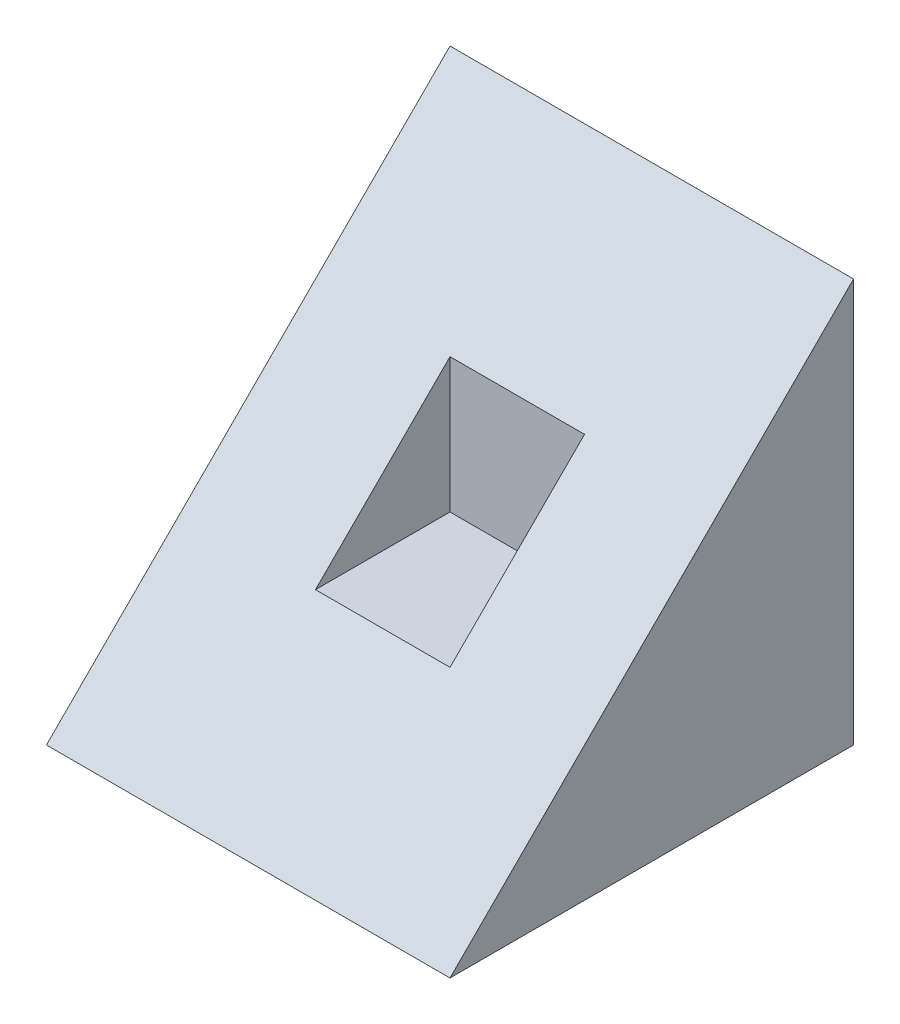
ISO-10303-21;
HEADER;
FILE_DESCRIPTION(('STEP AP214'),'2;1');
FILE_NAME('part.step','',(''),(''),'','','');
FILE_SCHEMA(('AUTOMOTIVE_DESIGN { 1 0 10303 214 1 1 1 1 }'));
ENDSEC;
DATA;
#1=APPLICATION_CONTEXT('core data for automotive mechanical design processes');
#2=APPLICATION_PROTOCOL_DEFINITION('international standard','automotive_design',2000,#1);
#3=PRODUCT_CONTEXT('',#1,'mechanical');
#4=PRODUCT('Part','Part','',(#3));
#5=PRODUCT_RELATED_PRODUCT_CATEGORY('part','',(#4));
#6=PRODUCT_DEFINITION_FORMATION('','',#4);
#7=PRODUCT_DEFINITION_CONTEXT('part definition',#1,'design');
#8=PRODUCT_DEFINITION('design','',#6,#7);
#9=PRODUCT_DEFINITION_SHAPE('','',#8);
#10=(LENGTH_UNIT() NAMED_UNIT(*) SI_UNIT(.MILLI.,.METRE.));
#11=(NAMED_UNIT(*) PLANE_ANGLE_UNIT() SI_UNIT($,.RADIAN.));
#12=(NAMED_UNIT(*) SI_UNIT($,.STERADIAN.) SOLID_ANGLE_UNIT());
#13=UNCERTAINTY_MEASURE_WITH_UNIT(LENGTH_MEASURE(1.E-05),#10,'distance_accuracy_value','');
#14=(GEOMETRIC_REPRESENTATION_CONTEXT(3) GLOBAL_UNCERTAINTY_ASSIGNED_CONTEXT((#13)) GLOBAL_UNIT_ASSIGNED_CONTEXT((#10,
#11,#12)) REPRESENTATION_CONTEXT('',''));
#15=CARTESIAN_POINT('',(0.,0.,0.));
#16=DIRECTION('',(0.,0.,1.));
#17=DIRECTION('',(1.,0.,0.));
#18=AXIS2_PLACEMENT_3D('',#15,#16,#17);
#19=CARTESIAN_POINT('',(76.2,76.2,-76.1999999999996));
#20=DIRECTION('',(0.,0.,-1.));
#21=DIRECTION('',(0.,1.,0.));
#22=AXIS2_PLACEMENT_3D('',#19,#20,#21);
#23=PLANE('',#22);
#24=DIRECTION('',(0.,-1.,0.));
#25=VECTOR('',#24,1.);
#26=CARTESIAN_POINT('',(-76.2,76.2,-76.1999999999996));
#27=LINE('',#26,#25);
#28=CARTESIAN_POINT('',(-76.2,76.2,-76.1999999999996));
#29=VERTEX_POINT('',#28);
#30=CARTESIAN_POINT('',(-76.2,-76.2,-76.2000000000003));
#31=VERTEX_POINT('',#30);
#32=EDGE_CURVE('E121',#29,#31,#27,.T.);
#33=ORIENTED_EDGE('',*,*,#32,.F.);
#34=DIRECTION('',(-1.,0.,0.));
#35=VECTOR('',#34,1.);
#36=CARTESIAN_POINT('',(76.2,76.2,-76.1999999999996));
#37=LINE('',#36,#35);
#38=CARTESIAN_POINT('',(76.2,76.2,-76.1999999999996));
#39=VERTEX_POINT('',#38);
#40=EDGE_CURVE('E58',#39,#29,#37,.T.);
#41=ORIENTED_EDGE('',*,*,#40,.F.);
#42=DIRECTION('',(0.,-1.,0.));
#43=VECTOR('',#42,1.);
#44=CARTESIAN_POINT('',(76.2,76.2,-76.1999999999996));
#45=LINE('',#44,#43);
#46=CARTESIAN_POINT('',(76.2,-76.2,-76.2000000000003));
#47=VERTEX_POINT('',#46);
#48=EDGE_CURVE('E123',#39,#47,#45,.T.);
#49=ORIENTED_EDGE('',*,*,#48,.T.);
#50=DIRECTION('',(-1.,0.,0.));
#51=VECTOR('',#50,1.);
#52=CARTESIAN_POINT('',(76.2,-76.2,-76.2000000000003));
#53=LINE('',#52,#51);
#54=EDGE_CURVE('E79',#47,#31,#53,.T.);
#55=ORIENTED_EDGE('',*,*,#54,.T.);
#56=EDGE_LOOP('',(#33,#41,#49,#55));
#57=FACE_BOUND('',#56,.T.);
#58=ADVANCED_FACE('F35',(#57),#23,.T.);
#59=CARTESIAN_POINT('',(76.2,76.2,-76.1999999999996));
#60=DIRECTION('',(0.,-0.707106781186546,-0.707106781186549));
#61=DIRECTION('',(0.,0.707106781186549,-0.707106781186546));
#62=AXIS2_PLACEMENT_3D('',#59,#60,#61);
#63=PLANE('',#62);
#64=DIRECTION('',(1.,0.,0.));
#65=VECTOR('',#64,1.);
#66=CARTESIAN_POINT('',(25.4,-25.4,25.4));
#67=LINE('',#66,#65);
#68=CARTESIAN_POINT('',(-25.4,-25.4,25.4));
#69=VERTEX_POINT('',#68);
#70=CARTESIAN_POINT('',(25.4,-25.4,25.4));
#71=VERTEX_POINT('',#70);
#72=EDGE_CURVE('E108',#69,#71,#67,.T.);
#73=ORIENTED_EDGE('',*,*,#72,.F.);
#74=DIRECTION('',(0.,0.707106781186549,-0.707106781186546));
#75=VECTOR('',#74,1.);
#76=CARTESIAN_POINT('',(-25.4,76.2,-76.1999999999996));
#77=LINE('',#76,#75);
#78=CARTESIAN_POINT('',(-25.4,25.4,-25.4));
#79=VERTEX_POINT('',#78);
#80=EDGE_CURVE('E11',#69,#79,#77,.T.);
#81=ORIENTED_EDGE('',*,*,#80,.T.);
#82=DIRECTION('',(-1.,0.,0.));
#83=VECTOR('',#82,1.);
#84=CARTESIAN_POINT('',(25.4,25.4,-25.4));
#85=LINE('',#84,#83);
#86=CARTESIAN_POINT('',(25.4,25.4,-25.3999999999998));
#87=VERTEX_POINT('',#86);
#88=EDGE_CURVE('E111',#87,#79,#85,.T.);
#89=ORIENTED_EDGE('',*,*,#88,.F.);
#90=DIRECTION('',(0.,-0.707106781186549,0.707106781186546));
#91=VECTOR('',#90,1.);
#92=CARTESIAN_POINT('',(25.4,76.2,-76.1999999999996));
#93=LINE('',#92,#91);
#94=EDGE_CURVE('E42',#87,#71,#93,.T.);
#95=ORIENTED_EDGE('',*,*,#94,.T.);
#96=EDGE_LOOP('',(#73,#81,#89,#95));
#97=FACE_BOUND('',#96,.T.);
#98=DIRECTION('',(0.,-0.707106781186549,0.707106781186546));
#99=VECTOR('',#98,1.);
#100=CARTESIAN_POINT('',(-76.2,76.2,-76.1999999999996));
#101=LINE('',#100,#99);
#102=CARTESIAN_POINT('',(-76.2,-76.2,76.1999999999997));
#103=VERTEX_POINT('',#102);
#104=EDGE_CURVE('E126',#29,#103,#101,.T.);
#105=ORIENTED_EDGE('',*,*,#104,.T.);
#106=DIRECTION('',(-1.,0.,0.));
#107=VECTOR('',#106,1.);
#108=CARTESIAN_POINT('',(76.2,-76.2,76.1999999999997));
#109=LINE('',#108,#107);
#110=CARTESIAN_POINT('',(76.2,-76.2,76.1999999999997));
#111=VERTEX_POINT('',#110);
#112=EDGE_CURVE('E137',#111,#103,#109,.T.);
#113=ORIENTED_EDGE('',*,*,#112,.F.);
#114=DIRECTION('',(0.,-0.707106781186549,0.707106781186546));
#115=VECTOR('',#114,1.);
#116=CARTESIAN_POINT('',(76.2,76.2,-76.1999999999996));
#117=LINE('',#116,#115);
#118=EDGE_CURVE('E128',#39,#111,#117,.T.);
#119=ORIENTED_EDGE('',*,*,#118,.F.);
#120=ORIENTED_EDGE('',*,*,#40,.T.);
#121=EDGE_LOOP('',(#105,#113,#119,#120));
#122=FACE_BOUND('',#121,.T.);
#123=ADVANCED_FACE('F113',(#97,#122),#63,.F.);
#124=CARTESIAN_POINT('',(76.2,-76.2,-76.2000000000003));
#125=DIRECTION('',(0.,-1.,0.));
#126=DIRECTION('',(0.,0.,-1.));
#127=AXIS2_PLACEMENT_3D('',#124,#125,#126);
#128=PLANE('',#127);
#129=DIRECTION('',(0.,0.,1.));
#130=VECTOR('',#129,1.);
#131=CARTESIAN_POINT('',(-76.2,-76.2,-76.2000000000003));
#132=LINE('',#131,#130);
#133=EDGE_CURVE('E132',#31,#103,#132,.T.);
#134=ORIENTED_EDGE('',*,*,#133,.F.);
#135=ORIENTED_EDGE('',*,*,#54,.F.);
#136=DIRECTION('',(0.,0.,1.));
#137=VECTOR('',#136,1.);
#138=CARTESIAN_POINT('',(76.2,-76.2,-76.2000000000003));
#139=LINE('',#138,#137);
#140=EDGE_CURVE('E125',#47,#111,#139,.T.);
#141=ORIENTED_EDGE('',*,*,#140,.T.);
#142=ORIENTED_EDGE('',*,*,#112,.T.);
#143=EDGE_LOOP('',(#134,#135,#141,#142));
#144=FACE_BOUND('',#143,.T.);
#145=ADVANCED_FACE('F140',(#144),#128,.T.);
#146=CARTESIAN_POINT('',(76.2,0.,0.));
#147=DIRECTION('',(-1.,0.,0.));
#148=DIRECTION('',(0.,0.,1.));
#149=AXIS2_PLACEMENT_3D('',#146,#147,#148);
#150=PLANE('',#149);
#151=ORIENTED_EDGE('',*,*,#48,.F.);
#152=ORIENTED_EDGE('',*,*,#118,.T.);
#153=ORIENTED_EDGE('',*,*,#140,.F.);
#154=EDGE_LOOP('',(#151,#152,#153));
#155=FACE_BOUND('',#154,.T.);
#156=ADVANCED_FACE('F145',(#155),#150,.F.);
#157=CARTESIAN_POINT('',(-76.2,0.,0.));
#158=DIRECTION('',(-1.,0.,0.));
#159=DIRECTION('',(0.,0.,1.));
#160=AXIS2_PLACEMENT_3D('',#157,#158,#159);
#161=PLANE('',#160);
#162=ORIENTED_EDGE('',*,*,#32,.T.);
#163=ORIENTED_EDGE('',*,*,#133,.T.);
#164=ORIENTED_EDGE('',*,*,#104,.F.);
#165=EDGE_LOOP('',(#162,#163,#164));
#166=FACE_BOUND('',#165,.T.);
#167=ADVANCED_FACE('F143',(#166),#161,.T.);
#168=CARTESIAN_POINT('',(-25.4,-25.4,-25.4));
#169=DIRECTION('',(-1.,0.,0.));
#170=DIRECTION('',(0.,0.,1.));
#171=AXIS2_PLACEMENT_3D('',#168,#169,#170);
#172=PLANE('',#171);
#173=DIRECTION('',(0.,0.,1.));
#174=VECTOR('',#173,1.);
#175=CARTESIAN_POINT('',(-25.4,-25.4,-25.4));
#176=LINE('',#175,#174);
#177=CARTESIAN_POINT('',(-25.4,-25.4,-25.4));
#178=VERTEX_POINT('',#177);
#179=EDGE_CURVE('E98',#178,#69,#176,.T.);
#180=ORIENTED_EDGE('',*,*,#179,.F.);
#181=DIRECTION('',(0.,1.,0.));
#182=VECTOR('',#181,1.);
#183=CARTESIAN_POINT('',(-25.4,-25.4,-25.4));
#184=LINE('',#183,#182);
#185=EDGE_CURVE('E100',#178,#79,#184,.T.);
#186=ORIENTED_EDGE('',*,*,#185,.T.);
#187=ORIENTED_EDGE('',*,*,#80,.F.);
#188=EDGE_LOOP('',(#180,#186,#187));
#189=FACE_BOUND('',#188,.T.);
#190=ADVANCED_FACE('F97',(#189),#172,.F.);
#191=CARTESIAN_POINT('',(25.4,-25.4,-25.4));
#192=DIRECTION('',(1.,0.,0.));
#193=DIRECTION('',(0.,0.,-1.));
#194=AXIS2_PLACEMENT_3D('',#191,#192,#193);
#195=PLANE('',#194);
#196=DIRECTION('',(0.,1.,0.));
#197=VECTOR('',#196,1.);
#198=CARTESIAN_POINT('',(25.4,-25.4,-25.4));
#199=LINE('',#198,#197);
#200=CARTESIAN_POINT('',(25.4,-25.4,-25.4));
#201=VERTEX_POINT('',#200);
#202=EDGE_CURVE('E49',#201,#87,#199,.T.);
#203=ORIENTED_EDGE('',*,*,#202,.F.);
#204=DIRECTION('',(0.,0.,-1.));
#205=VECTOR('',#204,1.);
#206=CARTESIAN_POINT('',(25.4,-25.4,-25.4));
#207=LINE('',#206,#205);
#208=EDGE_CURVE('E114',#71,#201,#207,.T.);
#209=ORIENTED_EDGE('',*,*,#208,.F.);
#210=ORIENTED_EDGE('',*,*,#94,.F.);
#211=EDGE_LOOP('',(#203,#209,#210));
#212=FACE_BOUND('',#211,.T.);
#213=ADVANCED_FACE('F186',(#212),#195,.F.);
#214=CARTESIAN_POINT('',(25.4,-25.4,-25.4));
#215=DIRECTION('',(0.,0.,-1.));
#216=DIRECTION('',(-1.,0.,0.));
#217=AXIS2_PLACEMENT_3D('',#214,#215,#216);
#218=PLANE('',#217);
#219=ORIENTED_EDGE('',*,*,#88,.T.);
#220=ORIENTED_EDGE('',*,*,#185,.F.);
#221=DIRECTION('',(-1.,0.,0.));
#222=VECTOR('',#221,1.);
#223=CARTESIAN_POINT('',(25.4,-25.4,-25.4));
#224=LINE('',#223,#222);
#225=EDGE_CURVE('E110',#201,#178,#224,.T.);
#226=ORIENTED_EDGE('',*,*,#225,.F.);
#227=ORIENTED_EDGE('',*,*,#202,.T.);
#228=EDGE_LOOP('',(#219,#220,#226,#227));
#229=FACE_BOUND('',#228,.T.);
#230=ADVANCED_FACE('F191',(#229),#218,.F.);
#231=CARTESIAN_POINT('',(0.,-25.4,0.));
#232=DIRECTION('',(0.,-1.,0.));
#233=DIRECTION('',(0.,0.,-1.));
#234=AXIS2_PLACEMENT_3D('',#231,#232,#233);
#235=PLANE('',#234);
#236=ORIENTED_EDGE('',*,*,#179,.T.);
#237=ORIENTED_EDGE('',*,*,#72,.T.);
#238=ORIENTED_EDGE('',*,*,#208,.T.);
#239=ORIENTED_EDGE('',*,*,#225,.T.);
#240=EDGE_LOOP('',(#236,#237,#238,#239));
#241=FACE_BOUND('',#240,.T.);
#242=ADVANCED_FACE('F106',(#241),#235,.F.);
#243=CLOSED_SHELL('',(#58,#123,#145,#156,#167,#190,#213,#230,#242));
#244=MANIFOLD_SOLID_BREP('B2',#243);
#245=ADVANCED_BREP_SHAPE_REPRESENTATION('',(#18,#244),#14);
#246=SHAPE_DEFINITION_REPRESENTATION(#9,#245);
ENDSEC;
END-ISO-10303-21;
